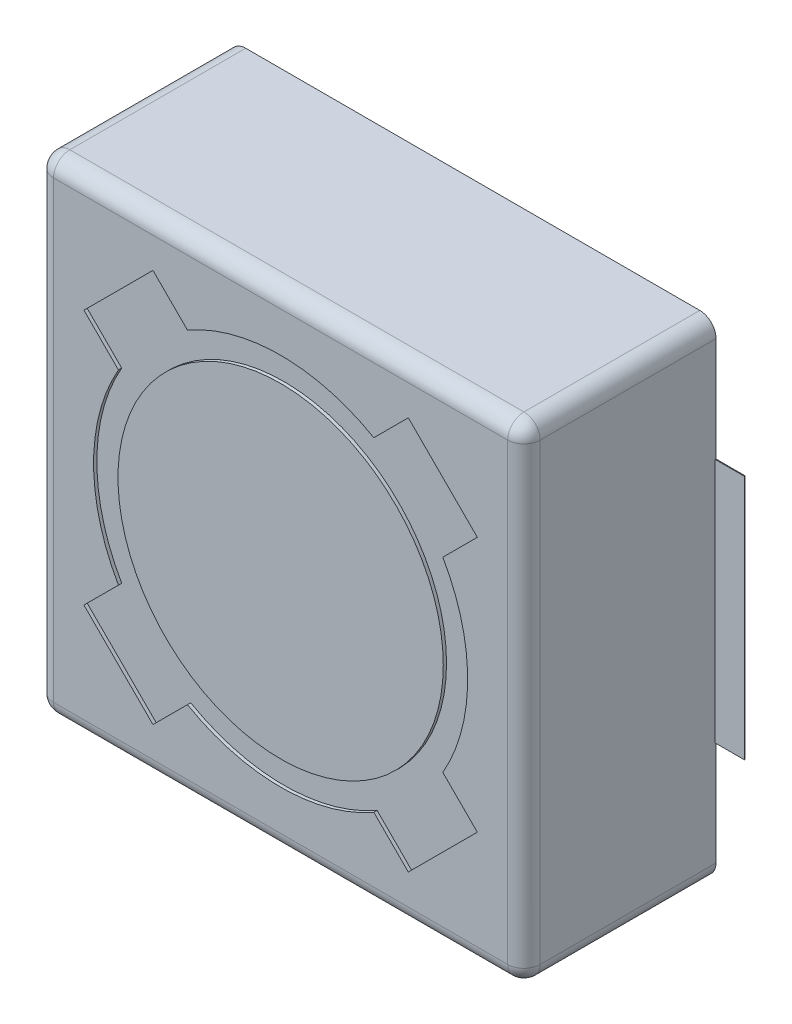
ISO-10303-21;
HEADER;
FILE_DESCRIPTION(('STEP AP214'),'2;1');
FILE_NAME('part.step','',(''),(''),'','','');
FILE_SCHEMA(('AUTOMOTIVE_DESIGN { 1 0 10303 214 1 1 1 1 }'));
ENDSEC;
DATA;
#1=APPLICATION_CONTEXT('core data for automotive mechanical design processes');
#2=APPLICATION_PROTOCOL_DEFINITION('international standard','automotive_design',2000,#1);
#3=PRODUCT_CONTEXT('',#1,'mechanical');
#4=PRODUCT('Part','Part','',(#3));
#5=PRODUCT_RELATED_PRODUCT_CATEGORY('part','',(#4));
#6=PRODUCT_DEFINITION_FORMATION('','',#4);
#7=PRODUCT_DEFINITION_CONTEXT('part definition',#1,'design');
#8=PRODUCT_DEFINITION('design','',#6,#7);
#9=PRODUCT_DEFINITION_SHAPE('','',#8);
#10=(LENGTH_UNIT() NAMED_UNIT(*) SI_UNIT(.MILLI.,.METRE.));
#11=(NAMED_UNIT(*) PLANE_ANGLE_UNIT() SI_UNIT($,.RADIAN.));
#12=(NAMED_UNIT(*) SI_UNIT($,.STERADIAN.) SOLID_ANGLE_UNIT());
#13=UNCERTAINTY_MEASURE_WITH_UNIT(LENGTH_MEASURE(1.E-05),#10,'distance_accuracy_value','');
#14=(GEOMETRIC_REPRESENTATION_CONTEXT(3) GLOBAL_UNCERTAINTY_ASSIGNED_CONTEXT((#13)) GLOBAL_UNIT_ASSIGNED_CONTEXT((#10,
#11,#12)) REPRESENTATION_CONTEXT('',''));
#15=CARTESIAN_POINT('',(0.,0.,0.));
#16=DIRECTION('',(0.,0.,1.));
#17=DIRECTION('',(1.,0.,0.));
#18=AXIS2_PLACEMENT_3D('',#15,#16,#17);
#19=CARTESIAN_POINT('',(0.,0.,3.076194));
#20=DIRECTION('',(0.,0.,1.));
#21=DIRECTION('',(1.,0.,0.));
#22=AXIS2_PLACEMENT_3D('',#19,#20,#21);
#23=PLANE('',#22);
#24=CARTESIAN_POINT('',(0.,0.,3.076194));
#25=DIRECTION('',(0.,0.,1.));
#26=DIRECTION('',(1.,0.,0.));
#27=AXIS2_PLACEMENT_3D('',#24,#25,#26);
#28=CIRCLE('',#27,2.54);
#29=CARTESIAN_POINT('',(2.54,0.,3.076194));
#30=VERTEX_POINT('',#29);
#31=EDGE_CURVE('E19',#30,#30,#28,.F.);
#32=ORIENTED_EDGE('',*,*,#31,.F.);
#33=EDGE_LOOP('',(#32));
#34=FACE_BOUND('',#33,.T.);
#35=ADVANCED_FACE('F16',(#34),#23,.T.);
#36=CARTESIAN_POINT('',(0.,0.,3.076194));
#37=DIRECTION('',(0.,0.,1.));
#38=DIRECTION('',(1.,0.,0.));
#39=AXIS2_PLACEMENT_3D('',#36,#37,#38);
#40=CYLINDRICAL_SURFACE('',#39,2.54);
#41=CARTESIAN_POINT('',(0.,0.,3.025394));
#42=DIRECTION('',(0.,0.,1.));
#43=DIRECTION('',(1.,0.,0.));
#44=AXIS2_PLACEMENT_3D('',#41,#42,#43);
#45=CIRCLE('',#44,2.54);
#46=CARTESIAN_POINT('',(2.54,0.,3.025394));
#47=VERTEX_POINT('',#46);
#48=EDGE_CURVE('E389',#47,#47,#45,.F.);
#49=ORIENTED_EDGE('',*,*,#48,.F.);
#50=EDGE_LOOP('',(#49));
#51=FACE_BOUND('',#50,.T.);
#52=ORIENTED_EDGE('',*,*,#31,.T.);
#53=EDGE_LOOP('',(#52));
#54=FACE_BOUND('',#53,.T.);
#55=ADVANCED_FACE('F829',(#51,#54),#40,.T.);
#56=CARTESIAN_POINT('',(0.,0.,3.025394));
#57=DIRECTION('',(0.,0.,1.));
#58=DIRECTION('',(1.,0.,0.));
#59=AXIS2_PLACEMENT_3D('',#56,#57,#58);
#60=PLANE('',#59);
#61=ORIENTED_EDGE('',*,*,#48,.T.);
#62=EDGE_LOOP('',(#61));
#63=FACE_BOUND('',#62,.T.);
#64=DIRECTION('',(-0.707106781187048,-0.707106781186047,0.));
#65=VECTOR('',#64,1.);
#66=CARTESIAN_POINT('',(1.99394044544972,3.07157117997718,3.025394));
#67=LINE('',#66,#65);
#68=CARTESIAN_POINT('',(1.99394044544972,3.07157117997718,3.025394));
#69=VERTEX_POINT('',#68);
#70=CARTESIAN_POINT('',(1.45512507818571,2.53275581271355,3.025394));
#71=VERTEX_POINT('',#70);
#72=EDGE_CURVE('E306',#69,#71,#67,.T.);
#73=ORIENTED_EDGE('',*,*,#72,.T.);
#74=CARTESIAN_POINT('',(0.,0.,3.025394));
#75=DIRECTION('',(0.,0.,1.));
#76=DIRECTION('',(1.,0.,0.));
#77=AXIS2_PLACEMENT_3D('',#74,#75,#76);
#78=CIRCLE('',#77,2.921);
#79=CARTESIAN_POINT('',(-1.45512507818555,2.53275581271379,3.025394));
#80=VERTEX_POINT('',#79);
#81=EDGE_CURVE('E377',#71,#80,#78,.T.);
#82=ORIENTED_EDGE('',*,*,#81,.T.);
#83=DIRECTION('',(-0.707106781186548,0.707106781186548,0.));
#84=VECTOR('',#83,1.);
#85=CARTESIAN_POINT('',(-1.45512507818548,2.5327558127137,3.025394));
#86=LINE('',#85,#84);
#87=CARTESIAN_POINT('',(-1.99394044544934,3.07157117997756,3.025394));
#88=VERTEX_POINT('',#87);
#89=EDGE_CURVE('E477',#80,#88,#86,.T.);
#90=ORIENTED_EDGE('',*,*,#89,.T.);
#91=DIRECTION('',(-0.707106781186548,-0.707106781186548,0.));
#92=VECTOR('',#91,1.);
#93=CARTESIAN_POINT('',(-1.99394044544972,3.07157117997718,3.025394));
#94=LINE('',#93,#92);
#95=CARTESIAN_POINT('',(-3.07157117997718,1.99394044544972,3.025394));
#96=VERTEX_POINT('',#95);
#97=EDGE_CURVE('E405',#88,#96,#94,.T.);
#98=ORIENTED_EDGE('',*,*,#97,.T.);
#99=DIRECTION('',(0.707106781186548,-0.707106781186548,0.));
#100=VECTOR('',#99,1.);
#101=CARTESIAN_POINT('',(-3.07157117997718,1.99394044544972,3.025394));
#102=LINE('',#101,#100);
#103=CARTESIAN_POINT('',(-2.53275581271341,1.45512507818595,3.025394));
#104=VERTEX_POINT('',#103);
#105=EDGE_CURVE('E385',#96,#104,#102,.T.);
#106=ORIENTED_EDGE('',*,*,#105,.T.);
#107=CARTESIAN_POINT('',(0.,0.,3.025394));
#108=DIRECTION('',(0.,0.,1.));
#109=DIRECTION('',(1.,0.,0.));
#110=AXIS2_PLACEMENT_3D('',#107,#108,#109);
#111=CIRCLE('',#110,2.921);
#112=CARTESIAN_POINT('',(-2.53275581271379,-1.45512507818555,3.025394));
#113=VERTEX_POINT('',#112);
#114=EDGE_CURVE('E382',#104,#113,#111,.T.);
#115=ORIENTED_EDGE('',*,*,#114,.T.);
#116=DIRECTION('',(-0.707106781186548,-0.707106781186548,0.));
#117=VECTOR('',#116,1.);
#118=CARTESIAN_POINT('',(-2.5327558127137,-1.45512507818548,3.025394));
#119=LINE('',#118,#117);
#120=CARTESIAN_POINT('',(-3.07157117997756,-1.99394044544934,3.025394));
#121=VERTEX_POINT('',#120);
#122=EDGE_CURVE('E416',#113,#121,#119,.T.);
#123=ORIENTED_EDGE('',*,*,#122,.T.);
#124=DIRECTION('',(0.707106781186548,-0.707106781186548,0.));
#125=VECTOR('',#124,1.);
#126=CARTESIAN_POINT('',(-3.07157117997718,-1.99394044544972,3.025394));
#127=LINE('',#126,#125);
#128=CARTESIAN_POINT('',(-1.99394044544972,-3.07157117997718,3.025394));
#129=VERTEX_POINT('',#128);
#130=EDGE_CURVE('E423',#121,#129,#127,.T.);
#131=ORIENTED_EDGE('',*,*,#130,.T.);
#132=DIRECTION('',(0.707106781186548,0.707106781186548,0.));
#133=VECTOR('',#132,1.);
#134=CARTESIAN_POINT('',(-1.99394044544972,-3.07157117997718,3.025394));
#135=LINE('',#134,#133);
#136=CARTESIAN_POINT('',(-1.45512507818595,-2.53275581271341,3.025394));
#137=VERTEX_POINT('',#136);
#138=EDGE_CURVE('E388',#129,#137,#135,.T.);
#139=ORIENTED_EDGE('',*,*,#138,.T.);
#140=CARTESIAN_POINT('',(0.,0.,3.025394));
#141=DIRECTION('',(0.,0.,1.));
#142=DIRECTION('',(1.,0.,0.));
#143=AXIS2_PLACEMENT_3D('',#140,#141,#142);
#144=CIRCLE('',#143,2.921);
#145=CARTESIAN_POINT('',(1.45512507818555,-2.53275581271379,3.025394));
#146=VERTEX_POINT('',#145);
#147=EDGE_CURVE('E290',#137,#146,#144,.T.);
#148=ORIENTED_EDGE('',*,*,#147,.T.);
#149=DIRECTION('',(0.707106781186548,-0.707106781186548,0.));
#150=VECTOR('',#149,1.);
#151=CARTESIAN_POINT('',(1.45512507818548,-2.5327558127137,3.025394));
#152=LINE('',#151,#150);
#153=CARTESIAN_POINT('',(1.99394044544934,-3.07157117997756,3.025394));
#154=VERTEX_POINT('',#153);
#155=EDGE_CURVE('E282',#146,#154,#152,.T.);
#156=ORIENTED_EDGE('',*,*,#155,.T.);
#157=DIRECTION('',(0.707106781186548,0.707106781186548,0.));
#158=VECTOR('',#157,1.);
#159=CARTESIAN_POINT('',(1.99394044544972,-3.07157117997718,3.025394));
#160=LINE('',#159,#158);
#161=CARTESIAN_POINT('',(3.07157117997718,-1.99394044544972,3.025394));
#162=VERTEX_POINT('',#161);
#163=EDGE_CURVE('E267',#154,#162,#160,.T.);
#164=ORIENTED_EDGE('',*,*,#163,.T.);
#165=DIRECTION('',(-0.707106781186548,0.707106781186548,0.));
#166=VECTOR('',#165,1.);
#167=CARTESIAN_POINT('',(3.07157117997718,-1.99394044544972,3.025394));
#168=LINE('',#167,#166);
#169=CARTESIAN_POINT('',(2.53275581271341,-1.45512507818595,3.025394));
#170=VERTEX_POINT('',#169);
#171=EDGE_CURVE('E301',#162,#170,#168,.T.);
#172=ORIENTED_EDGE('',*,*,#171,.T.);
#173=CARTESIAN_POINT('',(0.,0.,3.025394));
#174=DIRECTION('',(0.,0.,1.));
#175=DIRECTION('',(1.,0.,0.));
#176=AXIS2_PLACEMENT_3D('',#173,#174,#175);
#177=CIRCLE('',#176,2.921);
#178=CARTESIAN_POINT('',(2.53275581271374,1.45512507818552,3.025394));
#179=VERTEX_POINT('',#178);
#180=EDGE_CURVE('E145',#170,#179,#177,.T.);
#181=ORIENTED_EDGE('',*,*,#180,.T.);
#182=DIRECTION('',(0.707106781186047,0.707106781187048,0.));
#183=VECTOR('',#182,1.);
#184=CARTESIAN_POINT('',(2.5327558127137,1.45512507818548,3.025394));
#185=LINE('',#184,#183);
#186=CARTESIAN_POINT('',(3.07157117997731,1.99394044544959,3.025394));
#187=VERTEX_POINT('',#186);
#188=EDGE_CURVE('E307',#179,#187,#185,.T.);
#189=ORIENTED_EDGE('',*,*,#188,.T.);
#190=DIRECTION('',(-0.707106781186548,0.707106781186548,0.));
#191=VECTOR('',#190,1.);
#192=CARTESIAN_POINT('',(3.07157117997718,1.99394044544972,3.025394));
#193=LINE('',#192,#191);
#194=EDGE_CURVE('E155',#187,#69,#193,.T.);
#195=ORIENTED_EDGE('',*,*,#194,.T.);
#196=EDGE_LOOP('',(#73,#82,#90,#98,#106,#115,#123,#131,#139,#148,#156,#164,#172,#181,#189,#195));
#197=FACE_BOUND('',#196,.T.);
#198=ADVANCED_FACE('F288',(#63,#197),#60,.T.);
#199=CARTESIAN_POINT('',(-3.54600000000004,3.81813888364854,2.822194));
#200=DIRECTION('',(0.,-1.,0.));
#201=DIRECTION('',(0.,0.,-1.));
#202=AXIS2_PLACEMENT_3D('',#199,#200,#201);
#203=CYLINDRICAL_SURFACE('',#202,0.254);
#204=CARTESIAN_POINT('',(-3.54600000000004,-3.54600000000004,2.822194));
#205=DIRECTION('',(0.,-1.,0.));
#206=DIRECTION('',(0.,0.,-1.));
#207=AXIS2_PLACEMENT_3D('',#204,#205,#206);
#208=CIRCLE('',#207,0.254);
#209=CARTESIAN_POINT('',(-3.54600000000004,-3.54600000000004,3.076194));
#210=VERTEX_POINT('',#209);
#211=CARTESIAN_POINT('',(-3.80000000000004,-3.54600000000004,2.822194));
#212=VERTEX_POINT('',#211);
#213=EDGE_CURVE('E370',#210,#212,#208,.T.);
#214=ORIENTED_EDGE('',*,*,#213,.F.);
#215=DIRECTION('',(0.,1.,0.));
#216=VECTOR('',#215,1.);
#217=CARTESIAN_POINT('',(-3.54600000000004,0.,3.076194));
#218=LINE('',#217,#216);
#219=CARTESIAN_POINT('',(-3.54600000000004,3.54600000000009,3.076194));
#220=VERTEX_POINT('',#219);
#221=EDGE_CURVE('E365',#220,#210,#218,.F.);
#222=ORIENTED_EDGE('',*,*,#221,.F.);
#223=CARTESIAN_POINT('',(-3.54600000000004,3.54600000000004,2.822194));
#224=DIRECTION('',(-3.72868402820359E-13,1.,-3.72868402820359E-13));
#225=DIRECTION('',(-0.707106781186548,0.,0.707106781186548));
#226=AXIS2_PLACEMENT_3D('',#223,#224,#225);
#227=CIRCLE('',#226,0.254);
#228=CARTESIAN_POINT('',(-3.72560512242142,3.54600000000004,3.00179912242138));
#229=VERTEX_POINT('',#228);
#230=EDGE_CURVE('E368',#229,#220,#227,.T.);
#231=ORIENTED_EDGE('',*,*,#230,.F.);
#232=CARTESIAN_POINT('',(-3.54600000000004,3.54600000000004,2.822194));
#233=DIRECTION('',(0.,-1.,0.));
#234=DIRECTION('',(0.,0.,-1.));
#235=AXIS2_PLACEMENT_3D('',#232,#233,#234);
#236=CIRCLE('',#235,0.254);
#237=CARTESIAN_POINT('',(-3.80000000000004,3.54600000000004,2.822194));
#238=VERTEX_POINT('',#237);
#239=EDGE_CURVE('E366',#238,#229,#236,.F.);
#240=ORIENTED_EDGE('',*,*,#239,.F.);
#241=DIRECTION('',(0.,1.,0.));
#242=VECTOR('',#241,1.);
#243=CARTESIAN_POINT('',(-3.80000000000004,3.80000000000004,2.822194));
#244=LINE('',#243,#242);
#245=EDGE_CURVE('E573',#212,#238,#244,.T.);
#246=ORIENTED_EDGE('',*,*,#245,.F.);
#247=EDGE_LOOP('',(#214,#222,#231,#240,#246));
#248=FACE_BOUND('',#247,.T.);
#249=ADVANCED_FACE('F802',(#248),#203,.T.);
#250=CARTESIAN_POINT('',(0.,0.,3.076194));
#251=DIRECTION('',(0.,0.,1.));
#252=DIRECTION('',(1.,0.,0.));
#253=AXIS2_PLACEMENT_3D('',#250,#251,#252);
#254=CYLINDRICAL_SURFACE('',#253,2.921);
#255=DIRECTION('',(0.,0.,1.));
#256=VECTOR('',#255,1.);
#257=CARTESIAN_POINT('',(2.53275581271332,-1.45512507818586,3.076194));
#258=LINE('',#257,#256);
#259=CARTESIAN_POINT('',(2.53275581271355,-1.45512507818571,3.076194));
#260=VERTEX_POINT('',#259);
#261=EDGE_CURVE('E277',#170,#260,#258,.T.);
#262=ORIENTED_EDGE('',*,*,#261,.T.);
#263=CARTESIAN_POINT('',(0.,0.,3.076194));
#264=DIRECTION('',(0.,0.,1.));
#265=DIRECTION('',(1.,0.,0.));
#266=AXIS2_PLACEMENT_3D('',#263,#264,#265);
#267=CIRCLE('',#266,2.921);
#268=CARTESIAN_POINT('',(2.53275581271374,1.45512507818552,3.076194));
#269=VERTEX_POINT('',#268);
#270=EDGE_CURVE('E362',#269,#260,#267,.F.);
#271=ORIENTED_EDGE('',*,*,#270,.F.);
#272=DIRECTION('',(0.,0.,1.));
#273=VECTOR('',#272,1.);
#274=CARTESIAN_POINT('',(2.5327558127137,1.45512507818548,3.076194));
#275=LINE('',#274,#273);
#276=EDGE_CURVE('E600',#269,#179,#275,.F.);
#277=ORIENTED_EDGE('',*,*,#276,.T.);
#278=ORIENTED_EDGE('',*,*,#180,.F.);
#279=EDGE_LOOP('',(#262,#271,#277,#278));
#280=FACE_BOUND('',#279,.T.);
#281=ADVANCED_FACE('F821',(#280),#254,.F.);
#282=CARTESIAN_POINT('',(3.07157117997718,-1.99394044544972,3.076194));
#283=DIRECTION('',(0.707106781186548,0.707106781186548,0.));
#284=DIRECTION('',(-0.707106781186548,0.707106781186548,0.));
#285=AXIS2_PLACEMENT_3D('',#282,#283,#284);
#286=PLANE('',#285);
#287=ORIENTED_EDGE('',*,*,#171,.F.);
#288=DIRECTION('',(0.,0.,1.));
#289=VECTOR('',#288,1.);
#290=CARTESIAN_POINT('',(3.07157117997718,-1.99394044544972,3.076194));
#291=LINE('',#290,#289);
#292=CARTESIAN_POINT('',(3.07157117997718,-1.99394044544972,3.076194));
#293=VERTEX_POINT('',#292);
#294=EDGE_CURVE('E274',#162,#293,#291,.T.);
#295=ORIENTED_EDGE('',*,*,#294,.T.);
#296=DIRECTION('',(0.707106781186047,-0.707106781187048,0.));
#297=VECTOR('',#296,1.);
#298=CARTESIAN_POINT('',(2.5327558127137,-1.45512507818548,3.076194));
#299=LINE('',#298,#297);
#300=EDGE_CURVE('E364',#260,#293,#299,.T.);
#301=ORIENTED_EDGE('',*,*,#300,.F.);
#302=ORIENTED_EDGE('',*,*,#261,.F.);
#303=EDGE_LOOP('',(#287,#295,#301,#302));
#304=FACE_BOUND('',#303,.T.);
#305=ADVANCED_FACE('F827',(#304),#286,.F.);
#306=CARTESIAN_POINT('',(1.99394044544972,-3.07157117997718,3.076194));
#307=DIRECTION('',(0.707106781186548,-0.707106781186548,0.));
#308=DIRECTION('',(0.707106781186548,0.707106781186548,0.));
#309=AXIS2_PLACEMENT_3D('',#306,#307,#308);
#310=PLANE('',#309);
#311=ORIENTED_EDGE('',*,*,#163,.F.);
#312=DIRECTION('',(0.,0.,1.));
#313=VECTOR('',#312,1.);
#314=CARTESIAN_POINT('',(1.99394044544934,-3.07157117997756,3.076194));
#315=LINE('',#314,#313);
#316=CARTESIAN_POINT('',(1.99394044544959,-3.07157117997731,3.076194));
#317=VERTEX_POINT('',#316);
#318=EDGE_CURVE('E271',#154,#317,#315,.T.);
#319=ORIENTED_EDGE('',*,*,#318,.T.);
#320=DIRECTION('',(-0.707106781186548,-0.707106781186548,0.));
#321=VECTOR('',#320,1.);
#322=CARTESIAN_POINT('',(3.07157117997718,-1.99394044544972,3.076194));
#323=LINE('',#322,#321);
#324=EDGE_CURVE('E441',#293,#317,#323,.T.);
#325=ORIENTED_EDGE('',*,*,#324,.F.);
#326=ORIENTED_EDGE('',*,*,#294,.F.);
#327=EDGE_LOOP('',(#311,#319,#325,#326));
#328=FACE_BOUND('',#327,.T.);
#329=ADVANCED_FACE('F269',(#328),#310,.F.);
#330=CARTESIAN_POINT('',(1.45512507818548,-2.5327558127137,3.076194));
#331=DIRECTION('',(-0.707106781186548,-0.707106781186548,0.));
#332=DIRECTION('',(0.707106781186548,-0.707106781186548,0.));
#333=AXIS2_PLACEMENT_3D('',#330,#331,#332);
#334=PLANE('',#333);
#335=ORIENTED_EDGE('',*,*,#155,.F.);
#336=DIRECTION('',(0.,0.,1.));
#337=VECTOR('',#336,1.);
#338=CARTESIAN_POINT('',(1.45512507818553,-2.5327558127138,3.076194));
#339=LINE('',#338,#337);
#340=CARTESIAN_POINT('',(1.45512507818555,-2.53275581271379,3.076194));
#341=VERTEX_POINT('',#340);
#342=EDGE_CURVE('E285',#146,#341,#339,.T.);
#343=ORIENTED_EDGE('',*,*,#342,.T.);
#344=DIRECTION('',(-0.707106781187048,0.707106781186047,0.));
#345=VECTOR('',#344,1.);
#346=CARTESIAN_POINT('',(1.99394044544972,-3.07157117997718,3.076194));
#347=LINE('',#346,#345);
#348=EDGE_CURVE('E284',#317,#341,#347,.T.);
#349=ORIENTED_EDGE('',*,*,#348,.F.);
#350=ORIENTED_EDGE('',*,*,#318,.F.);
#351=EDGE_LOOP('',(#335,#343,#349,#350));
#352=FACE_BOUND('',#351,.T.);
#353=ADVANCED_FACE('F280',(#352),#334,.F.);
#354=CARTESIAN_POINT('',(0.,0.,3.076194));
#355=DIRECTION('',(0.,0.,1.));
#356=DIRECTION('',(1.,0.,0.));
#357=AXIS2_PLACEMENT_3D('',#354,#355,#356);
#358=CYLINDRICAL_SURFACE('',#357,2.921);
#359=DIRECTION('',(0.,0.,1.));
#360=VECTOR('',#359,1.);
#361=CARTESIAN_POINT('',(-1.45512507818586,-2.53275581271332,3.076194));
#362=LINE('',#361,#360);
#363=CARTESIAN_POINT('',(-1.45512507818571,-2.53275581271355,3.076194));
#364=VERTEX_POINT('',#363);
#365=EDGE_CURVE('E426',#137,#364,#362,.T.);
#366=ORIENTED_EDGE('',*,*,#365,.T.);
#367=CARTESIAN_POINT('',(0.,0.,3.076194));
#368=DIRECTION('',(0.,0.,1.));
#369=DIRECTION('',(1.,0.,0.));
#370=AXIS2_PLACEMENT_3D('',#367,#368,#369);
#371=CIRCLE('',#370,2.921);
#372=EDGE_CURVE('E359',#341,#364,#371,.F.);
#373=ORIENTED_EDGE('',*,*,#372,.F.);
#374=ORIENTED_EDGE('',*,*,#342,.F.);
#375=ORIENTED_EDGE('',*,*,#147,.F.);
#376=EDGE_LOOP('',(#366,#373,#374,#375));
#377=FACE_BOUND('',#376,.T.);
#378=ADVANCED_FACE('F896',(#377),#358,.F.);
#379=CARTESIAN_POINT('',(-1.99394044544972,-3.07157117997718,3.076194));
#380=DIRECTION('',(0.707106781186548,-0.707106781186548,0.));
#381=DIRECTION('',(0.707106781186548,0.707106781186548,0.));
#382=AXIS2_PLACEMENT_3D('',#379,#380,#381);
#383=PLANE('',#382);
#384=ORIENTED_EDGE('',*,*,#138,.F.);
#385=DIRECTION('',(0.,0.,1.));
#386=VECTOR('',#385,1.);
#387=CARTESIAN_POINT('',(-1.99394044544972,-3.07157117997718,3.076194));
#388=LINE('',#387,#386);
#389=CARTESIAN_POINT('',(-1.99394044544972,-3.07157117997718,3.076194));
#390=VERTEX_POINT('',#389);
#391=EDGE_CURVE('E420',#129,#390,#388,.T.);
#392=ORIENTED_EDGE('',*,*,#391,.T.);
#393=DIRECTION('',(-0.707106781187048,-0.707106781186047,0.));
#394=VECTOR('',#393,1.);
#395=CARTESIAN_POINT('',(-1.45512507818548,-2.5327558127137,3.076194));
#396=LINE('',#395,#394);
#397=EDGE_CURVE('E361',#364,#390,#396,.T.);
#398=ORIENTED_EDGE('',*,*,#397,.F.);
#399=ORIENTED_EDGE('',*,*,#365,.F.);
#400=EDGE_LOOP('',(#384,#392,#398,#399));
#401=FACE_BOUND('',#400,.T.);
#402=ADVANCED_FACE('F508',(#401),#383,.F.);
#403=CARTESIAN_POINT('',(-3.07157117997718,-1.99394044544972,3.076194));
#404=DIRECTION('',(-0.707106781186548,-0.707106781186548,0.));
#405=DIRECTION('',(0.707106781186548,-0.707106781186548,0.));
#406=AXIS2_PLACEMENT_3D('',#403,#404,#405);
#407=PLANE('',#406);
#408=ORIENTED_EDGE('',*,*,#130,.F.);
#409=DIRECTION('',(0.,0.,1.));
#410=VECTOR('',#409,1.);
#411=CARTESIAN_POINT('',(-3.07157117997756,-1.99394044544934,3.076194));
#412=LINE('',#411,#410);
#413=CARTESIAN_POINT('',(-3.07157117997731,-1.99394044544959,3.076194));
#414=VERTEX_POINT('',#413);
#415=EDGE_CURVE('E419',#121,#414,#412,.T.);
#416=ORIENTED_EDGE('',*,*,#415,.T.);
#417=DIRECTION('',(-0.707106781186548,0.707106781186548,0.));
#418=VECTOR('',#417,1.);
#419=CARTESIAN_POINT('',(-1.99394044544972,-3.07157117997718,3.076194));
#420=LINE('',#419,#418);
#421=EDGE_CURVE('E501',#390,#414,#420,.T.);
#422=ORIENTED_EDGE('',*,*,#421,.F.);
#423=ORIENTED_EDGE('',*,*,#391,.F.);
#424=EDGE_LOOP('',(#408,#416,#422,#423));
#425=FACE_BOUND('',#424,.T.);
#426=ADVANCED_FACE('F510',(#425),#407,.F.);
#427=CARTESIAN_POINT('',(-2.5327558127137,-1.45512507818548,3.076194));
#428=DIRECTION('',(-0.707106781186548,0.707106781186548,0.));
#429=DIRECTION('',(-0.707106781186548,-0.707106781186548,0.));
#430=AXIS2_PLACEMENT_3D('',#427,#428,#429);
#431=PLANE('',#430);
#432=ORIENTED_EDGE('',*,*,#122,.F.);
#433=DIRECTION('',(0.,0.,1.));
#434=VECTOR('',#433,1.);
#435=CARTESIAN_POINT('',(-2.5327558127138,-1.45512507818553,3.076194));
#436=LINE('',#435,#434);
#437=CARTESIAN_POINT('',(-2.53275581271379,-1.45512507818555,3.076194));
#438=VERTEX_POINT('',#437);
#439=EDGE_CURVE('E386',#113,#438,#436,.T.);
#440=ORIENTED_EDGE('',*,*,#439,.T.);
#441=DIRECTION('',(0.707106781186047,0.707106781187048,0.));
#442=VECTOR('',#441,1.);
#443=CARTESIAN_POINT('',(-3.07157117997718,-1.99394044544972,3.076194));
#444=LINE('',#443,#442);
#445=EDGE_CURVE('E358',#414,#438,#444,.T.);
#446=ORIENTED_EDGE('',*,*,#445,.F.);
#447=ORIENTED_EDGE('',*,*,#415,.F.);
#448=EDGE_LOOP('',(#432,#440,#446,#447));
#449=FACE_BOUND('',#448,.T.);
#450=ADVANCED_FACE('F921',(#449),#431,.F.);
#451=CARTESIAN_POINT('',(0.,0.,3.076194));
#452=DIRECTION('',(0.,0.,1.));
#453=DIRECTION('',(1.,0.,0.));
#454=AXIS2_PLACEMENT_3D('',#451,#452,#453);
#455=CYLINDRICAL_SURFACE('',#454,2.921);
#456=DIRECTION('',(0.,0.,1.));
#457=VECTOR('',#456,1.);
#458=CARTESIAN_POINT('',(-2.53275581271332,1.45512507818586,3.076194));
#459=LINE('',#458,#457);
#460=CARTESIAN_POINT('',(-2.53275581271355,1.45512507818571,3.076194));
#461=VERTEX_POINT('',#460);
#462=EDGE_CURVE('E409',#104,#461,#459,.T.);
#463=ORIENTED_EDGE('',*,*,#462,.T.);
#464=CARTESIAN_POINT('',(0.,0.,3.076194));
#465=DIRECTION('',(0.,0.,1.));
#466=DIRECTION('',(1.,0.,0.));
#467=AXIS2_PLACEMENT_3D('',#464,#465,#466);
#468=CIRCLE('',#467,2.921);
#469=EDGE_CURVE('E355',#438,#461,#468,.F.);
#470=ORIENTED_EDGE('',*,*,#469,.F.);
#471=ORIENTED_EDGE('',*,*,#439,.F.);
#472=ORIENTED_EDGE('',*,*,#114,.F.);
#473=EDGE_LOOP('',(#463,#470,#471,#472));
#474=FACE_BOUND('',#473,.T.);
#475=ADVANCED_FACE('F930',(#474),#455,.F.);
#476=CARTESIAN_POINT('',(-3.07157117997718,1.99394044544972,3.076194));
#477=DIRECTION('',(-0.707106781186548,-0.707106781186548,0.));
#478=DIRECTION('',(0.707106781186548,-0.707106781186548,0.));
#479=AXIS2_PLACEMENT_3D('',#476,#477,#478);
#480=PLANE('',#479);
#481=ORIENTED_EDGE('',*,*,#105,.F.);
#482=DIRECTION('',(0.,0.,1.));
#483=VECTOR('',#482,1.);
#484=CARTESIAN_POINT('',(-3.07157117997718,1.99394044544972,3.076194));
#485=LINE('',#484,#483);
#486=CARTESIAN_POINT('',(-3.07157117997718,1.99394044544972,3.076194));
#487=VERTEX_POINT('',#486);
#488=EDGE_CURVE('E408',#96,#487,#485,.T.);
#489=ORIENTED_EDGE('',*,*,#488,.T.);
#490=DIRECTION('',(-0.707106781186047,0.707106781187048,0.));
#491=VECTOR('',#490,1.);
#492=CARTESIAN_POINT('',(-2.5327558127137,1.45512507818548,3.076194));
#493=LINE('',#492,#491);
#494=EDGE_CURVE('E357',#461,#487,#493,.T.);
#495=ORIENTED_EDGE('',*,*,#494,.F.);
#496=ORIENTED_EDGE('',*,*,#462,.F.);
#497=EDGE_LOOP('',(#481,#489,#495,#496));
#498=FACE_BOUND('',#497,.T.);
#499=ADVANCED_FACE('F940',(#498),#480,.F.);
#500=CARTESIAN_POINT('',(-1.99394044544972,3.07157117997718,3.076194));
#501=DIRECTION('',(-0.707106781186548,0.707106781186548,0.));
#502=DIRECTION('',(-0.707106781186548,-0.707106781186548,0.));
#503=AXIS2_PLACEMENT_3D('',#500,#501,#502);
#504=PLANE('',#503);
#505=ORIENTED_EDGE('',*,*,#97,.F.);
#506=DIRECTION('',(0.,0.,1.));
#507=VECTOR('',#506,1.);
#508=CARTESIAN_POINT('',(-1.99394044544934,3.07157117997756,3.076194));
#509=LINE('',#508,#507);
#510=CARTESIAN_POINT('',(-1.99394044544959,3.07157117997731,3.076194));
#511=VERTEX_POINT('',#510);
#512=EDGE_CURVE('E381',#88,#511,#509,.T.);
#513=ORIENTED_EDGE('',*,*,#512,.T.);
#514=DIRECTION('',(0.707106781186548,0.707106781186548,0.));
#515=VECTOR('',#514,1.);
#516=CARTESIAN_POINT('',(-3.07157117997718,1.99394044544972,3.076194));
#517=LINE('',#516,#515);
#518=EDGE_CURVE('E621',#487,#511,#517,.T.);
#519=ORIENTED_EDGE('',*,*,#518,.F.);
#520=ORIENTED_EDGE('',*,*,#488,.F.);
#521=EDGE_LOOP('',(#505,#513,#519,#520));
#522=FACE_BOUND('',#521,.T.);
#523=ADVANCED_FACE('F950',(#522),#504,.F.);
#524=CARTESIAN_POINT('',(-1.45512507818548,2.5327558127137,3.076194));
#525=DIRECTION('',(0.707106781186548,0.707106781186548,0.));
#526=DIRECTION('',(-0.707106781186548,0.707106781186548,0.));
#527=AXIS2_PLACEMENT_3D('',#524,#525,#526);
#528=PLANE('',#527);
#529=ORIENTED_EDGE('',*,*,#89,.F.);
#530=DIRECTION('',(0.,0.,1.));
#531=VECTOR('',#530,1.);
#532=CARTESIAN_POINT('',(-1.45512507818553,2.5327558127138,3.076194));
#533=LINE('',#532,#531);
#534=CARTESIAN_POINT('',(-1.45512507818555,2.53275581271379,3.076194));
#535=VERTEX_POINT('',#534);
#536=EDGE_CURVE('E380',#80,#535,#533,.T.);
#537=ORIENTED_EDGE('',*,*,#536,.T.);
#538=DIRECTION('',(0.707106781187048,-0.707106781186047,0.));
#539=VECTOR('',#538,1.);
#540=CARTESIAN_POINT('',(-1.99394044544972,3.07157117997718,3.076194));
#541=LINE('',#540,#539);
#542=EDGE_CURVE('E354',#511,#535,#541,.T.);
#543=ORIENTED_EDGE('',*,*,#542,.F.);
#544=ORIENTED_EDGE('',*,*,#512,.F.);
#545=EDGE_LOOP('',(#529,#537,#543,#544));
#546=FACE_BOUND('',#545,.T.);
#547=ADVANCED_FACE('F959',(#546),#528,.F.);
#548=CARTESIAN_POINT('',(0.,0.,3.076194));
#549=DIRECTION('',(0.,0.,1.));
#550=DIRECTION('',(1.,0.,0.));
#551=AXIS2_PLACEMENT_3D('',#548,#549,#550);
#552=CYLINDRICAL_SURFACE('',#551,2.921);
#553=ORIENTED_EDGE('',*,*,#536,.F.);
#554=ORIENTED_EDGE('',*,*,#81,.F.);
#555=DIRECTION('',(0.,0.,1.));
#556=VECTOR('',#555,1.);
#557=CARTESIAN_POINT('',(1.45512507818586,2.53275581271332,3.076194));
#558=LINE('',#557,#556);
#559=CARTESIAN_POINT('',(1.45512507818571,2.53275581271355,3.076194));
#560=VERTEX_POINT('',#559);
#561=EDGE_CURVE('E613',#71,#560,#558,.T.);
#562=ORIENTED_EDGE('',*,*,#561,.T.);
#563=CARTESIAN_POINT('',(0.,0.,3.076194));
#564=DIRECTION('',(0.,0.,1.));
#565=DIRECTION('',(1.,0.,0.));
#566=AXIS2_PLACEMENT_3D('',#563,#564,#565);
#567=CIRCLE('',#566,2.921);
#568=EDGE_CURVE('E351',#535,#560,#567,.F.);
#569=ORIENTED_EDGE('',*,*,#568,.F.);
#570=EDGE_LOOP('',(#553,#554,#562,#569));
#571=FACE_BOUND('',#570,.T.);
#572=ADVANCED_FACE('F969',(#571),#552,.F.);
#573=CARTESIAN_POINT('',(1.99394044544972,3.07157117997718,3.076194));
#574=DIRECTION('',(-0.707106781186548,0.707106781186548,0.));
#575=DIRECTION('',(-0.707106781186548,-0.707106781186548,0.));
#576=AXIS2_PLACEMENT_3D('',#573,#574,#575);
#577=PLANE('',#576);
#578=ORIENTED_EDGE('',*,*,#72,.F.);
#579=DIRECTION('',(0.,0.,1.));
#580=VECTOR('',#579,1.);
#581=CARTESIAN_POINT('',(1.99394044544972,3.07157117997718,3.076194));
#582=LINE('',#581,#580);
#583=CARTESIAN_POINT('',(1.99394044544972,3.07157117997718,3.076194));
#584=VERTEX_POINT('',#583);
#585=EDGE_CURVE('E602',#69,#584,#582,.T.);
#586=ORIENTED_EDGE('',*,*,#585,.T.);
#587=DIRECTION('',(0.707106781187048,0.707106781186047,0.));
#588=VECTOR('',#587,1.);
#589=CARTESIAN_POINT('',(1.45512507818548,2.5327558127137,3.076194));
#590=LINE('',#589,#588);
#591=EDGE_CURVE('E353',#560,#584,#590,.T.);
#592=ORIENTED_EDGE('',*,*,#591,.F.);
#593=ORIENTED_EDGE('',*,*,#561,.F.);
#594=EDGE_LOOP('',(#578,#586,#592,#593));
#595=FACE_BOUND('',#594,.T.);
#596=ADVANCED_FACE('F979',(#595),#577,.F.);
#597=CARTESIAN_POINT('',(3.07157117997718,1.99394044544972,3.076194));
#598=DIRECTION('',(0.707106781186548,0.707106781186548,0.));
#599=DIRECTION('',(-0.707106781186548,0.707106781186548,0.));
#600=AXIS2_PLACEMENT_3D('',#597,#598,#599);
#601=PLANE('',#600);
#602=ORIENTED_EDGE('',*,*,#194,.F.);
#603=DIRECTION('',(0.,0.,1.));
#604=VECTOR('',#603,1.);
#605=CARTESIAN_POINT('',(3.07157117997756,1.99394044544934,3.076194));
#606=LINE('',#605,#604);
#607=CARTESIAN_POINT('',(3.07157117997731,1.99394044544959,3.076194));
#608=VERTEX_POINT('',#607);
#609=EDGE_CURVE('E376',#187,#608,#606,.T.);
#610=ORIENTED_EDGE('',*,*,#609,.T.);
#611=DIRECTION('',(0.707106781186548,-0.707106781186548,0.));
#612=VECTOR('',#611,1.);
#613=CARTESIAN_POINT('',(1.99394044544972,3.07157117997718,3.076194));
#614=LINE('',#613,#612);
#615=EDGE_CURVE('E607',#584,#608,#614,.T.);
#616=ORIENTED_EDGE('',*,*,#615,.F.);
#617=ORIENTED_EDGE('',*,*,#585,.F.);
#618=EDGE_LOOP('',(#602,#610,#616,#617));
#619=FACE_BOUND('',#618,.T.);
#620=ADVANCED_FACE('F989',(#619),#601,.F.);
#621=CARTESIAN_POINT('',(2.5327558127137,1.45512507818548,3.076194));
#622=DIRECTION('',(0.707106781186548,-0.707106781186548,0.));
#623=DIRECTION('',(0.707106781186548,0.707106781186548,0.));
#624=AXIS2_PLACEMENT_3D('',#621,#622,#623);
#625=PLANE('',#624);
#626=ORIENTED_EDGE('',*,*,#188,.F.);
#627=ORIENTED_EDGE('',*,*,#276,.F.);
#628=DIRECTION('',(-0.707106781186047,-0.707106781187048,0.));
#629=VECTOR('',#628,1.);
#630=CARTESIAN_POINT('',(3.07157117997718,1.99394044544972,3.076194));
#631=LINE('',#630,#629);
#632=EDGE_CURVE('E350',#608,#269,#631,.T.);
#633=ORIENTED_EDGE('',*,*,#632,.F.);
#634=ORIENTED_EDGE('',*,*,#609,.F.);
#635=EDGE_LOOP('',(#626,#627,#633,#634));
#636=FACE_BOUND('',#635,.T.);
#637=ADVANCED_FACE('F999',(#636),#625,.F.);
#638=CARTESIAN_POINT('',(3.54600000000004,-3.81778924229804,2.822194));
#639=DIRECTION('',(0.,1.,0.));
#640=DIRECTION('',(0.,0.,1.));
#641=AXIS2_PLACEMENT_3D('',#638,#639,#640);
#642=CYLINDRICAL_SURFACE('',#641,0.254);
#643=CARTESIAN_POINT('',(3.54600000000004,-3.54600000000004,2.822194));
#644=DIRECTION('',(0.,1.,0.));
#645=DIRECTION('',(0.,0.,1.));
#646=AXIS2_PLACEMENT_3D('',#643,#644,#645);
#647=CIRCLE('',#646,0.254);
#648=CARTESIAN_POINT('',(3.80000000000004,-3.54600000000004,2.822194));
#649=VERTEX_POINT('',#648);
#650=CARTESIAN_POINT('',(3.72560512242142,-3.54600000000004,3.00179912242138));
#651=VERTEX_POINT('',#650);
#652=EDGE_CURVE('E374',#649,#651,#647,.F.);
#653=ORIENTED_EDGE('',*,*,#652,.F.);
#654=DIRECTION('',(0.,1.,0.));
#655=VECTOR('',#654,1.);
#656=CARTESIAN_POINT('',(3.80000000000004,-3.80000000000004,2.822194));
#657=LINE('',#656,#655);
#658=CARTESIAN_POINT('',(3.80000000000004,3.54600000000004,2.822194));
#659=VERTEX_POINT('',#658);
#660=EDGE_CURVE('E567',#659,#649,#657,.F.);
#661=ORIENTED_EDGE('',*,*,#660,.F.);
#662=CARTESIAN_POINT('',(3.54600000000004,3.54600000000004,2.822194));
#663=DIRECTION('',(0.,1.,0.));
#664=DIRECTION('',(0.,0.,1.));
#665=AXIS2_PLACEMENT_3D('',#662,#663,#664);
#666=CIRCLE('',#665,0.254);
#667=CARTESIAN_POINT('',(3.54600000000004,3.54600000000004,3.076194));
#668=VERTEX_POINT('',#667);
#669=EDGE_CURVE('E347',#668,#659,#666,.T.);
#670=ORIENTED_EDGE('',*,*,#669,.F.);
#671=DIRECTION('',(0.,1.,0.));
#672=VECTOR('',#671,1.);
#673=CARTESIAN_POINT('',(3.54600000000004,0.,3.076194));
#674=LINE('',#673,#672);
#675=CARTESIAN_POINT('',(3.54600000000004,-3.54600000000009,3.076194));
#676=VERTEX_POINT('',#675);
#677=EDGE_CURVE('E529',#676,#668,#674,.T.);
#678=ORIENTED_EDGE('',*,*,#677,.F.);
#679=CARTESIAN_POINT('',(3.54600000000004,-3.54600000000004,2.822194));
#680=DIRECTION('',(3.72868402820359E-13,-1.,-3.72868402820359E-13));
#681=DIRECTION('',(0.707106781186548,0.,0.707106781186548));
#682=AXIS2_PLACEMENT_3D('',#679,#680,#681);
#683=CIRCLE('',#682,0.254);
#684=EDGE_CURVE('E373',#651,#676,#683,.T.);
#685=ORIENTED_EDGE('',*,*,#684,.F.);
#686=EDGE_LOOP('',(#653,#661,#670,#678,#685));
#687=FACE_BOUND('',#686,.T.);
#688=ADVANCED_FACE('F790',(#687),#642,.T.);
#689=CARTESIAN_POINT('',(3.54600000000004,-3.54600000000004,2.822194));
#690=DIRECTION('',(0.707106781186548,0.,0.707106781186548));
#691=DIRECTION('',(0.,-1.,0.));
#692=AXIS2_PLACEMENT_3D('',#689,#690,#691);
#693=SPHERICAL_SURFACE('',#692,0.254);
#694=ORIENTED_EDGE('',*,*,#652,.T.);
#695=ORIENTED_EDGE('',*,*,#684,.T.);
#696=CARTESIAN_POINT('',(3.54600000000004,-3.54600000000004,2.822194));
#697=DIRECTION('',(1.,0.,0.));
#698=DIRECTION('',(0.,0.,-1.));
#699=AXIS2_PLACEMENT_3D('',#696,#697,#698);
#700=CIRCLE('',#699,0.254);
#701=CARTESIAN_POINT('',(3.54600000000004,-3.80000000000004,2.822194));
#702=VERTEX_POINT('',#701);
#703=EDGE_CURVE('E334',#702,#676,#700,.F.);
#704=ORIENTED_EDGE('',*,*,#703,.F.);
#705=CARTESIAN_POINT('',(3.54600000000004,-3.54600000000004,2.822194));
#706=DIRECTION('',(0.,0.,-1.));
#707=DIRECTION('',(-1.,0.,0.));
#708=AXIS2_PLACEMENT_3D('',#705,#706,#707);
#709=CIRCLE('',#708,0.254);
#710=EDGE_CURVE('E337',#649,#702,#709,.T.);
#711=ORIENTED_EDGE('',*,*,#710,.F.);
#712=EDGE_LOOP('',(#694,#695,#704,#711));
#713=FACE_BOUND('',#712,.T.);
#714=ADVANCED_FACE('F550',(#713),#693,.T.);
#715=CARTESIAN_POINT('',(-3.54600000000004,-3.54600000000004,2.822194));
#716=DIRECTION('',(-0.707106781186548,-0.707106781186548,0.));
#717=DIRECTION('',(0.,0.,1.));
#718=AXIS2_PLACEMENT_3D('',#715,#716,#717);
#719=SPHERICAL_SURFACE('',#718,0.254);
#720=CARTESIAN_POINT('',(-3.54600000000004,-3.54600000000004,2.822194));
#721=DIRECTION('',(0.,0.,-1.));
#722=DIRECTION('',(-1.,0.,0.));
#723=AXIS2_PLACEMENT_3D('',#720,#721,#722);
#724=CIRCLE('',#723,0.254);
#725=CARTESIAN_POINT('',(-3.72560512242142,-3.72560512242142,2.822194));
#726=VERTEX_POINT('',#725);
#727=EDGE_CURVE('E342',#726,#212,#724,.T.);
#728=ORIENTED_EDGE('',*,*,#727,.F.);
#729=CARTESIAN_POINT('',(-3.54600000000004,-3.54600000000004,2.822194));
#730=DIRECTION('',(0.,0.,-1.));
#731=DIRECTION('',(-1.,0.,0.));
#732=AXIS2_PLACEMENT_3D('',#729,#730,#731);
#733=CIRCLE('',#732,0.254);
#734=CARTESIAN_POINT('',(-3.54600000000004,-3.80000000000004,2.822194));
#735=VERTEX_POINT('',#734);
#736=EDGE_CURVE('E34',#735,#726,#733,.T.);
#737=ORIENTED_EDGE('',*,*,#736,.F.);
#738=CARTESIAN_POINT('',(-3.54600000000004,-3.54600000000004,2.822194));
#739=DIRECTION('',(1.,0.,0.));
#740=DIRECTION('',(0.,0.,-1.));
#741=AXIS2_PLACEMENT_3D('',#738,#739,#740);
#742=CIRCLE('',#741,0.254);
#743=EDGE_CURVE('E329',#210,#735,#742,.T.);
#744=ORIENTED_EDGE('',*,*,#743,.F.);
#745=ORIENTED_EDGE('',*,*,#213,.T.);
#746=EDGE_LOOP('',(#728,#737,#744,#745));
#747=FACE_BOUND('',#746,.T.);
#748=ADVANCED_FACE('F545',(#747),#719,.T.);
#749=CARTESIAN_POINT('',(-3.80000000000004,3.80000000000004,0.0762));
#750=DIRECTION('',(-1.,0.,0.));
#751=DIRECTION('',(0.,0.,1.));
#752=AXIS2_PLACEMENT_3D('',#749,#750,#751);
#753=PLANE('',#752);
#754=DIRECTION('',(0.,0.,1.));
#755=VECTOR('',#754,1.);
#756=CARTESIAN_POINT('',(-3.80000000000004,1.9174968,0.0762));
#757=LINE('',#756,#755);
#758=CARTESIAN_POINT('',(-3.80000000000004,1.9174968,0.0762));
#759=VERTEX_POINT('',#758);
#760=CARTESIAN_POINT('',(-3.80000000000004,1.9174968,0.0889));
#761=VERTEX_POINT('',#760);
#762=EDGE_CURVE('E369',#759,#761,#757,.T.);
#763=ORIENTED_EDGE('',*,*,#762,.T.);
#764=DIRECTION('',(0.,1.,0.));
#765=VECTOR('',#764,1.);
#766=CARTESIAN_POINT('',(-3.80000000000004,0.,0.0889));
#767=LINE('',#766,#765);
#768=CARTESIAN_POINT('',(-3.80000000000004,-1.9174968,0.0889));
#769=VERTEX_POINT('',#768);
#770=EDGE_CURVE('E346',#769,#761,#767,.T.);
#771=ORIENTED_EDGE('',*,*,#770,.F.);
#772=DIRECTION('',(0.,0.,1.));
#773=VECTOR('',#772,1.);
#774=CARTESIAN_POINT('',(-3.80000000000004,-1.9174968,0.0762));
#775=LINE('',#774,#773);
#776=CARTESIAN_POINT('',(-3.80000000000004,-1.9174968,0.0762));
#777=VERTEX_POINT('',#776);
#778=EDGE_CURVE('E372',#769,#777,#775,.F.);
#779=ORIENTED_EDGE('',*,*,#778,.T.);
#780=DIRECTION('',(0.,1.,0.));
#781=VECTOR('',#780,1.);
#782=CARTESIAN_POINT('',(-3.80000000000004,3.80000000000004,0.0762));
#783=LINE('',#782,#781);
#784=CARTESIAN_POINT('',(-3.80000000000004,-3.54600000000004,0.0761999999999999));
#785=VERTEX_POINT('',#784);
#786=EDGE_CURVE('E466',#777,#785,#783,.F.);
#787=ORIENTED_EDGE('',*,*,#786,.T.);
#788=DIRECTION('',(0.,0.,-1.));
#789=VECTOR('',#788,1.);
#790=CARTESIAN_POINT('',(-3.80000000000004,-3.54600000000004,3.09465279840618));
#791=LINE('',#790,#789);
#792=EDGE_CURVE('E341',#212,#785,#791,.T.);
#793=ORIENTED_EDGE('',*,*,#792,.F.);
#794=ORIENTED_EDGE('',*,*,#245,.T.);
#795=DIRECTION('',(0.,0.,-1.));
#796=VECTOR('',#795,1.);
#797=CARTESIAN_POINT('',(-3.80000000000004,3.54600000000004,3.09465279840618));
#798=LINE('',#797,#796);
#799=CARTESIAN_POINT('',(-3.80000000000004,3.54600000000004,0.0761999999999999));
#800=VERTEX_POINT('',#799);
#801=EDGE_CURVE('E325',#800,#238,#798,.F.);
#802=ORIENTED_EDGE('',*,*,#801,.F.);
#803=DIRECTION('',(0.,1.,0.));
#804=VECTOR('',#803,1.);
#805=CARTESIAN_POINT('',(-3.80000000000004,3.80000000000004,0.0762));
#806=LINE('',#805,#804);
#807=EDGE_CURVE('E456',#800,#759,#806,.F.);
#808=ORIENTED_EDGE('',*,*,#807,.T.);
#809=EDGE_LOOP('',(#763,#771,#779,#787,#793,#794,#802,#808));
#810=FACE_BOUND('',#809,.T.);
#811=ADVANCED_FACE('F540',(#810),#753,.T.);
#812=CARTESIAN_POINT('',(-3.54600000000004,3.54600000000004,2.822194));
#813=DIRECTION('',(-0.707106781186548,0.,0.707106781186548));
#814=DIRECTION('',(0.,1.,0.));
#815=AXIS2_PLACEMENT_3D('',#812,#813,#814);
#816=SPHERICAL_SURFACE('',#815,0.254);
#817=ORIENTED_EDGE('',*,*,#239,.T.);
#818=ORIENTED_EDGE('',*,*,#230,.T.);
#819=CARTESIAN_POINT('',(-3.54600000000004,3.54600000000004,2.822194));
#820=DIRECTION('',(-1.,0.,0.));
#821=DIRECTION('',(0.,0.,1.));
#822=AXIS2_PLACEMENT_3D('',#819,#820,#821);
#823=CIRCLE('',#822,0.254);
#824=CARTESIAN_POINT('',(-3.54600000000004,3.80000000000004,2.822194));
#825=VERTEX_POINT('',#824);
#826=EDGE_CURVE('E319',#825,#220,#823,.F.);
#827=ORIENTED_EDGE('',*,*,#826,.F.);
#828=CARTESIAN_POINT('',(-3.54600000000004,3.54600000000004,2.822194));
#829=DIRECTION('',(0.,0.,-1.));
#830=DIRECTION('',(-1.,0.,0.));
#831=AXIS2_PLACEMENT_3D('',#828,#829,#830);
#832=CIRCLE('',#831,0.254);
#833=EDGE_CURVE('E323',#238,#825,#832,.T.);
#834=ORIENTED_EDGE('',*,*,#833,.F.);
#835=EDGE_LOOP('',(#817,#818,#827,#834));
#836=FACE_BOUND('',#835,.T.);
#837=ADVANCED_FACE('F536',(#836),#816,.T.);
#838=CARTESIAN_POINT('',(0.,0.,3.076194));
#839=DIRECTION('',(0.,0.,1.));
#840=DIRECTION('',(1.,0.,0.));
#841=AXIS2_PLACEMENT_3D('',#838,#839,#840);
#842=PLANE('',#841);
#843=ORIENTED_EDGE('',*,*,#615,.T.);
#844=ORIENTED_EDGE('',*,*,#632,.T.);
#845=ORIENTED_EDGE('',*,*,#270,.T.);
#846=ORIENTED_EDGE('',*,*,#300,.T.);
#847=ORIENTED_EDGE('',*,*,#324,.T.);
#848=ORIENTED_EDGE('',*,*,#348,.T.);
#849=ORIENTED_EDGE('',*,*,#372,.T.);
#850=ORIENTED_EDGE('',*,*,#397,.T.);
#851=ORIENTED_EDGE('',*,*,#421,.T.);
#852=ORIENTED_EDGE('',*,*,#445,.T.);
#853=ORIENTED_EDGE('',*,*,#469,.T.);
#854=ORIENTED_EDGE('',*,*,#494,.T.);
#855=ORIENTED_EDGE('',*,*,#518,.T.);
#856=ORIENTED_EDGE('',*,*,#542,.T.);
#857=ORIENTED_EDGE('',*,*,#568,.T.);
#858=ORIENTED_EDGE('',*,*,#591,.T.);
#859=EDGE_LOOP('',(#843,#844,#845,#846,#847,#848,#849,#850,#851,#852,#853,#854,#855,#856,#857,#858));
#860=FACE_BOUND('',#859,.T.);
#861=ORIENTED_EDGE('',*,*,#221,.T.);
#862=DIRECTION('',(1.,0.,0.));
#863=VECTOR('',#862,1.);
#864=CARTESIAN_POINT('',(-3.81813888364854,-3.54600000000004,3.076194));
#865=LINE('',#864,#863);
#866=EDGE_CURVE('E333',#676,#210,#865,.F.);
#867=ORIENTED_EDGE('',*,*,#866,.F.);
#868=ORIENTED_EDGE('',*,*,#677,.T.);
#869=DIRECTION('',(-1.,0.,0.));
#870=VECTOR('',#869,1.);
#871=CARTESIAN_POINT('',(3.8174410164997,3.54600000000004,3.076194));
#872=LINE('',#871,#870);
#873=EDGE_CURVE('E322',#220,#668,#872,.F.);
#874=ORIENTED_EDGE('',*,*,#873,.F.);
#875=EDGE_LOOP('',(#861,#867,#868,#874));
#876=FACE_BOUND('',#875,.T.);
#877=ADVANCED_FACE('F514',(#860,#876),#842,.T.);
#878=CARTESIAN_POINT('',(3.54600000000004,3.54600000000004,2.822194));
#879=DIRECTION('',(0.,0.707106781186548,0.707106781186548));
#880=DIRECTION('',(1.,0.,0.));
#881=AXIS2_PLACEMENT_3D('',#878,#879,#880);
#882=SPHERICAL_SURFACE('',#881,0.254);
#883=CARTESIAN_POINT('',(3.54600000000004,3.54600000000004,2.822194));
#884=DIRECTION('',(-1.,0.,0.));
#885=DIRECTION('',(0.,0.,1.));
#886=AXIS2_PLACEMENT_3D('',#883,#884,#885);
#887=CIRCLE('',#886,0.254);
#888=CARTESIAN_POINT('',(3.54600000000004,3.72560512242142,3.00179912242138));
#889=VERTEX_POINT('',#888);
#890=CARTESIAN_POINT('',(3.54600000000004,3.80000000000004,2.822194));
#891=VERTEX_POINT('',#890);
#892=EDGE_CURVE('E316',#889,#891,#887,.T.);
#893=ORIENTED_EDGE('',*,*,#892,.F.);
#894=CARTESIAN_POINT('',(3.54600000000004,3.54600000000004,2.822194));
#895=DIRECTION('',(-1.,0.,0.));
#896=DIRECTION('',(0.,0.,1.));
#897=AXIS2_PLACEMENT_3D('',#894,#895,#896);
#898=CIRCLE('',#897,0.254);
#899=EDGE_CURVE('E318',#668,#889,#898,.T.);
#900=ORIENTED_EDGE('',*,*,#899,.F.);
#901=ORIENTED_EDGE('',*,*,#669,.T.);
#902=CARTESIAN_POINT('',(3.54600000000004,3.54600000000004,2.822194));
#903=DIRECTION('',(0.,0.,-1.));
#904=DIRECTION('',(-1.,0.,0.));
#905=AXIS2_PLACEMENT_3D('',#902,#903,#904);
#906=CIRCLE('',#905,0.254);
#907=EDGE_CURVE('E310',#891,#659,#906,.T.);
#908=ORIENTED_EDGE('',*,*,#907,.F.);
#909=EDGE_LOOP('',(#893,#900,#901,#908));
#910=FACE_BOUND('',#909,.T.);
#911=ADVANCED_FACE('F648',(#910),#882,.T.);
#912=CARTESIAN_POINT('',(3.80000000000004,-3.80000000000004,0.0762));
#913=DIRECTION('',(1.,0.,0.));
#914=DIRECTION('',(0.,0.,-1.));
#915=AXIS2_PLACEMENT_3D('',#912,#913,#914);
#916=PLANE('',#915);
#917=DIRECTION('',(0.,0.,-1.));
#918=VECTOR('',#917,1.);
#919=CARTESIAN_POINT('',(3.80000000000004,-1.9174968,0.0762));
#920=LINE('',#919,#918);
#921=CARTESIAN_POINT('',(3.80000000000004,-1.9174968,0.0762));
#922=VERTEX_POINT('',#921);
#923=CARTESIAN_POINT('',(3.80000000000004,-1.9174968,0.0889));
#924=VERTEX_POINT('',#923);
#925=EDGE_CURVE('E471',#922,#924,#920,.F.);
#926=ORIENTED_EDGE('',*,*,#925,.T.);
#927=DIRECTION('',(0.,1.,0.));
#928=VECTOR('',#927,1.);
#929=CARTESIAN_POINT('',(3.80000000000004,0.,0.0889));
#930=LINE('',#929,#928);
#931=CARTESIAN_POINT('',(3.80000000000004,1.9174968,0.0889));
#932=VERTEX_POINT('',#931);
#933=EDGE_CURVE('E328',#932,#924,#930,.F.);
#934=ORIENTED_EDGE('',*,*,#933,.F.);
#935=DIRECTION('',(0.,0.,-1.));
#936=VECTOR('',#935,1.);
#937=CARTESIAN_POINT('',(3.80000000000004,1.9174968,0.0762));
#938=LINE('',#937,#936);
#939=CARTESIAN_POINT('',(3.80000000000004,1.9174968,0.0762));
#940=VERTEX_POINT('',#939);
#941=EDGE_CURVE('E349',#932,#940,#938,.T.);
#942=ORIENTED_EDGE('',*,*,#941,.T.);
#943=DIRECTION('',(0.,1.,0.));
#944=VECTOR('',#943,1.);
#945=CARTESIAN_POINT('',(3.80000000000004,-3.80000000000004,0.0762));
#946=LINE('',#945,#944);
#947=CARTESIAN_POINT('',(3.80000000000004,3.54600000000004,0.0761999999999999));
#948=VERTEX_POINT('',#947);
#949=EDGE_CURVE('E590',#940,#948,#946,.T.);
#950=ORIENTED_EDGE('',*,*,#949,.T.);
#951=DIRECTION('',(0.,0.,-1.));
#952=VECTOR('',#951,1.);
#953=CARTESIAN_POINT('',(3.80000000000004,3.54600000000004,3.09465279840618));
#954=LINE('',#953,#952);
#955=EDGE_CURVE('E313',#659,#948,#954,.T.);
#956=ORIENTED_EDGE('',*,*,#955,.F.);
#957=ORIENTED_EDGE('',*,*,#660,.T.);
#958=DIRECTION('',(0.,0.,-1.));
#959=VECTOR('',#958,1.);
#960=CARTESIAN_POINT('',(3.80000000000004,-3.54600000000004,3.09465279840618));
#961=LINE('',#960,#959);
#962=CARTESIAN_POINT('',(3.80000000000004,-3.54600000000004,0.0761999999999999));
#963=VERTEX_POINT('',#962);
#964=EDGE_CURVE('E339',#963,#649,#961,.F.);
#965=ORIENTED_EDGE('',*,*,#964,.F.);
#966=DIRECTION('',(0.,1.,0.));
#967=VECTOR('',#966,1.);
#968=CARTESIAN_POINT('',(3.80000000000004,-3.80000000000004,0.0762));
#969=LINE('',#968,#967);
#970=EDGE_CURVE('E565',#963,#922,#969,.T.);
#971=ORIENTED_EDGE('',*,*,#970,.T.);
#972=EDGE_LOOP('',(#926,#934,#942,#950,#956,#957,#965,#971));
#973=FACE_BOUND('',#972,.T.);
#974=ADVANCED_FACE('F651',(#973),#916,.T.);
#975=CARTESIAN_POINT('',(0.,0.,0.0889));
#976=DIRECTION('',(0.,0.,1.));
#977=DIRECTION('',(1.,0.,0.));
#978=AXIS2_PLACEMENT_3D('',#975,#976,#977);
#979=PLANE('',#978);
#980=DIRECTION('',(1.,0.,0.));
#981=VECTOR('',#980,1.);
#982=CARTESIAN_POINT('',(0.,-1.9174968,0.0889));
#983=LINE('',#982,#981);
#984=CARTESIAN_POINT('',(-4.2545,-1.9174968,0.0889));
#985=VERTEX_POINT('',#984);
#986=EDGE_CURVE('E469',#985,#769,#983,.T.);
#987=ORIENTED_EDGE('',*,*,#986,.T.);
#988=ORIENTED_EDGE('',*,*,#770,.T.);
#989=DIRECTION('',(1.,0.,0.));
#990=VECTOR('',#989,1.);
#991=CARTESIAN_POINT('',(-1.7655032,1.9174968,0.0889));
#992=LINE('',#991,#990);
#993=CARTESIAN_POINT('',(-4.2545,1.9174968,0.0889));
#994=VERTEX_POINT('',#993);
#995=EDGE_CURVE('E643',#994,#761,#992,.T.);
#996=ORIENTED_EDGE('',*,*,#995,.F.);
#997=DIRECTION('',(0.,1.,0.));
#998=VECTOR('',#997,1.);
#999=CARTESIAN_POINT('',(-4.2545,1.9174968,0.0889));
#1000=LINE('',#999,#998);
#1001=EDGE_CURVE('E762',#985,#994,#1000,.T.);
#1002=ORIENTED_EDGE('',*,*,#1001,.F.);
#1003=EDGE_LOOP('',(#987,#988,#996,#1002));
#1004=FACE_BOUND('',#1003,.T.);
#1005=ADVANCED_FACE('F655',(#1004),#979,.T.);
#1006=CARTESIAN_POINT('',(-3.54600000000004,-3.54600000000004,3.09465279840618));
#1007=DIRECTION('',(0.,0.,-1.));
#1008=DIRECTION('',(-1.,0.,0.));
#1009=AXIS2_PLACEMENT_3D('',#1006,#1007,#1008);
#1010=CYLINDRICAL_SURFACE('',#1009,0.254);
#1011=ORIENTED_EDGE('',*,*,#727,.T.);
#1012=ORIENTED_EDGE('',*,*,#792,.T.);
#1013=CARTESIAN_POINT('',(-3.54600000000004,-3.54600000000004,0.0761999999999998));
#1014=DIRECTION('',(0.,0.,-1.));
#1015=DIRECTION('',(-1.,0.,0.));
#1016=AXIS2_PLACEMENT_3D('',#1013,#1014,#1015);
#1017=CIRCLE('',#1016,0.254);
#1018=CARTESIAN_POINT('',(-3.54600000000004,-3.80000000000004,0.0761999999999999));
#1019=VERTEX_POINT('',#1018);
#1020=EDGE_CURVE('E344',#785,#1019,#1017,.F.);
#1021=ORIENTED_EDGE('',*,*,#1020,.T.);
#1022=DIRECTION('',(0.,0.,-1.));
#1023=VECTOR('',#1022,1.);
#1024=CARTESIAN_POINT('',(-3.54600000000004,-3.80000000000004,0.0762));
#1025=LINE('',#1024,#1023);
#1026=EDGE_CURVE('E752',#735,#1019,#1025,.T.);
#1027=ORIENTED_EDGE('',*,*,#1026,.F.);
#1028=ORIENTED_EDGE('',*,*,#736,.T.);
#1029=EDGE_LOOP('',(#1011,#1012,#1021,#1027,#1028));
#1030=FACE_BOUND('',#1029,.T.);
#1031=ADVANCED_FACE('F659',(#1030),#1010,.T.);
#1032=CARTESIAN_POINT('',(3.54600000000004,-3.54600000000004,3.09465279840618));
#1033=DIRECTION('',(0.,0.,-1.));
#1034=DIRECTION('',(-1.,0.,0.));
#1035=AXIS2_PLACEMENT_3D('',#1032,#1033,#1034);
#1036=CYLINDRICAL_SURFACE('',#1035,0.254);
#1037=ORIENTED_EDGE('',*,*,#710,.T.);
#1038=DIRECTION('',(0.,0.,-1.));
#1039=VECTOR('',#1038,1.);
#1040=CARTESIAN_POINT('',(3.54600000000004,-3.80000000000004,0.0762));
#1041=LINE('',#1040,#1039);
#1042=CARTESIAN_POINT('',(3.54600000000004,-3.80000000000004,0.0761999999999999));
#1043=VERTEX_POINT('',#1042);
#1044=EDGE_CURVE('E755',#1043,#702,#1041,.F.);
#1045=ORIENTED_EDGE('',*,*,#1044,.F.);
#1046=CARTESIAN_POINT('',(3.54600000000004,-3.54600000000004,0.0761999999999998));
#1047=DIRECTION('',(0.,0.,-1.));
#1048=DIRECTION('',(-1.,0.,0.));
#1049=AXIS2_PLACEMENT_3D('',#1046,#1047,#1048);
#1050=CIRCLE('',#1049,0.254);
#1051=EDGE_CURVE('E194',#1043,#963,#1050,.F.);
#1052=ORIENTED_EDGE('',*,*,#1051,.T.);
#1053=ORIENTED_EDGE('',*,*,#964,.T.);
#1054=EDGE_LOOP('',(#1037,#1045,#1052,#1053));
#1055=FACE_BOUND('',#1054,.T.);
#1056=ADVANCED_FACE('F663',(#1055),#1036,.T.);
#1057=CARTESIAN_POINT('',(-3.81813888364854,-3.54600000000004,2.822194));
#1058=DIRECTION('',(1.,0.,0.));
#1059=DIRECTION('',(0.,0.,-1.));
#1060=AXIS2_PLACEMENT_3D('',#1057,#1058,#1059);
#1061=CYLINDRICAL_SURFACE('',#1060,0.254);
#1062=ORIENTED_EDGE('',*,*,#743,.T.);
#1063=DIRECTION('',(1.,0.,0.));
#1064=VECTOR('',#1063,1.);
#1065=CARTESIAN_POINT('',(-3.80000000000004,-3.80000000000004,2.822194));
#1066=LINE('',#1065,#1064);
#1067=EDGE_CURVE('E751',#702,#735,#1066,.F.);
#1068=ORIENTED_EDGE('',*,*,#1067,.F.);
#1069=ORIENTED_EDGE('',*,*,#703,.T.);
#1070=ORIENTED_EDGE('',*,*,#866,.T.);
#1071=EDGE_LOOP('',(#1062,#1068,#1069,#1070));
#1072=FACE_BOUND('',#1071,.T.);
#1073=ADVANCED_FACE('F666',(#1072),#1061,.T.);
#1074=CARTESIAN_POINT('',(0.,0.,0.0889));
#1075=DIRECTION('',(0.,0.,1.));
#1076=DIRECTION('',(1.,0.,0.));
#1077=AXIS2_PLACEMENT_3D('',#1074,#1075,#1076);
#1078=PLANE('',#1077);
#1079=DIRECTION('',(1.,0.,0.));
#1080=VECTOR('',#1079,1.);
#1081=CARTESIAN_POINT('',(0.,1.9174968,0.0889));
#1082=LINE('',#1081,#1080);
#1083=CARTESIAN_POINT('',(4.2545,1.9174968,0.0889));
#1084=VERTEX_POINT('',#1083);
#1085=EDGE_CURVE('E332',#1084,#932,#1082,.F.);
#1086=ORIENTED_EDGE('',*,*,#1085,.T.);
#1087=ORIENTED_EDGE('',*,*,#933,.T.);
#1088=DIRECTION('',(1.,0.,0.));
#1089=VECTOR('',#1088,1.);
#1090=CARTESIAN_POINT('',(1.7655032,-1.9174968,0.0889));
#1091=LINE('',#1090,#1089);
#1092=CARTESIAN_POINT('',(4.2545,-1.9174968,0.0889));
#1093=VERTEX_POINT('',#1092);
#1094=EDGE_CURVE('E748',#1093,#924,#1091,.F.);
#1095=ORIENTED_EDGE('',*,*,#1094,.F.);
#1096=DIRECTION('',(0.,1.,0.));
#1097=VECTOR('',#1096,1.);
#1098=CARTESIAN_POINT('',(4.2545,-1.9174968,0.0889));
#1099=LINE('',#1098,#1097);
#1100=EDGE_CURVE('E746',#1084,#1093,#1099,.F.);
#1101=ORIENTED_EDGE('',*,*,#1100,.F.);
#1102=EDGE_LOOP('',(#1086,#1087,#1095,#1101));
#1103=FACE_BOUND('',#1102,.T.);
#1104=ADVANCED_FACE('F670',(#1103),#1078,.T.);
#1105=CARTESIAN_POINT('',(-3.54600000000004,3.54600000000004,3.09465279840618));
#1106=DIRECTION('',(0.,0.,-1.));
#1107=DIRECTION('',(-1.,0.,0.));
#1108=AXIS2_PLACEMENT_3D('',#1105,#1106,#1107);
#1109=CYLINDRICAL_SURFACE('',#1108,0.254);
#1110=ORIENTED_EDGE('',*,*,#833,.T.);
#1111=DIRECTION('',(0.,0.,1.));
#1112=VECTOR('',#1111,1.);
#1113=CARTESIAN_POINT('',(-3.54600000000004,3.80000000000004,0.0762));
#1114=LINE('',#1113,#1112);
#1115=CARTESIAN_POINT('',(-3.54600000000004,3.80000000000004,0.0761999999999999));
#1116=VERTEX_POINT('',#1115);
#1117=EDGE_CURVE('E731',#1116,#825,#1114,.T.);
#1118=ORIENTED_EDGE('',*,*,#1117,.F.);
#1119=CARTESIAN_POINT('',(-3.54600000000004,3.54600000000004,0.0761999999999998));
#1120=DIRECTION('',(0.,0.,-1.));
#1121=DIRECTION('',(-1.,0.,0.));
#1122=AXIS2_PLACEMENT_3D('',#1119,#1120,#1121);
#1123=CIRCLE('',#1122,0.254);
#1124=EDGE_CURVE('E326',#1116,#800,#1123,.F.);
#1125=ORIENTED_EDGE('',*,*,#1124,.T.);
#1126=ORIENTED_EDGE('',*,*,#801,.T.);
#1127=EDGE_LOOP('',(#1110,#1118,#1125,#1126));
#1128=FACE_BOUND('',#1127,.T.);
#1129=ADVANCED_FACE('F674',(#1128),#1109,.T.);
#1130=CARTESIAN_POINT('',(3.8174410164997,3.54600000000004,2.822194));
#1131=DIRECTION('',(-1.,0.,0.));
#1132=DIRECTION('',(0.,0.,1.));
#1133=AXIS2_PLACEMENT_3D('',#1130,#1131,#1132);
#1134=CYLINDRICAL_SURFACE('',#1133,0.254);
#1135=ORIENTED_EDGE('',*,*,#892,.T.);
#1136=DIRECTION('',(1.,0.,0.));
#1137=VECTOR('',#1136,1.);
#1138=CARTESIAN_POINT('',(3.80000000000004,3.80000000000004,2.822194));
#1139=LINE('',#1138,#1137);
#1140=EDGE_CURVE('E735',#825,#891,#1139,.T.);
#1141=ORIENTED_EDGE('',*,*,#1140,.F.);
#1142=ORIENTED_EDGE('',*,*,#826,.T.);
#1143=ORIENTED_EDGE('',*,*,#873,.T.);
#1144=ORIENTED_EDGE('',*,*,#899,.T.);
#1145=EDGE_LOOP('',(#1135,#1141,#1142,#1143,#1144));
#1146=FACE_BOUND('',#1145,.T.);
#1147=ADVANCED_FACE('F678',(#1146),#1134,.T.);
#1148=CARTESIAN_POINT('',(3.54600000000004,3.54600000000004,3.09465279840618));
#1149=DIRECTION('',(0.,0.,-1.));
#1150=DIRECTION('',(-1.,0.,0.));
#1151=AXIS2_PLACEMENT_3D('',#1148,#1149,#1150);
#1152=CYLINDRICAL_SURFACE('',#1151,0.254);
#1153=ORIENTED_EDGE('',*,*,#907,.T.);
#1154=ORIENTED_EDGE('',*,*,#955,.T.);
#1155=CARTESIAN_POINT('',(3.54600000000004,3.54600000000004,0.0761999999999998));
#1156=DIRECTION('',(0.,0.,-1.));
#1157=DIRECTION('',(-1.,0.,0.));
#1158=AXIS2_PLACEMENT_3D('',#1155,#1156,#1157);
#1159=CIRCLE('',#1158,0.254);
#1160=CARTESIAN_POINT('',(3.54600000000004,3.80000000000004,0.0761999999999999));
#1161=VERTEX_POINT('',#1160);
#1162=EDGE_CURVE('E314',#948,#1161,#1159,.F.);
#1163=ORIENTED_EDGE('',*,*,#1162,.T.);
#1164=DIRECTION('',(0.,0.,1.));
#1165=VECTOR('',#1164,1.);
#1166=CARTESIAN_POINT('',(3.54600000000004,3.80000000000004,0.0762));
#1167=LINE('',#1166,#1165);
#1168=EDGE_CURVE('E452',#891,#1161,#1167,.F.);
#1169=ORIENTED_EDGE('',*,*,#1168,.F.);
#1170=EDGE_LOOP('',(#1153,#1154,#1163,#1169));
#1171=FACE_BOUND('',#1170,.T.);
#1172=ADVANCED_FACE('F682',(#1171),#1152,.T.);
#1173=CARTESIAN_POINT('',(-1.7655032,1.9174968,0.0762));
#1174=DIRECTION('',(0.,1.,0.));
#1175=DIRECTION('',(0.,0.,1.));
#1176=AXIS2_PLACEMENT_3D('',#1173,#1174,#1175);
#1177=PLANE('',#1176);
#1178=ORIENTED_EDGE('',*,*,#995,.T.);
#1179=ORIENTED_EDGE('',*,*,#762,.F.);
#1180=DIRECTION('',(1.,0.,0.));
#1181=VECTOR('',#1180,1.);
#1182=CARTESIAN_POINT('',(0.,1.9174968,0.0762));
#1183=LINE('',#1182,#1181);
#1184=CARTESIAN_POINT('',(-4.2545,1.9174968,0.0762));
#1185=VERTEX_POINT('',#1184);
#1186=EDGE_CURVE('E448',#759,#1185,#1183,.F.);
#1187=ORIENTED_EDGE('',*,*,#1186,.T.);
#1188=DIRECTION('',(0.,0.,1.));
#1189=VECTOR('',#1188,1.);
#1190=CARTESIAN_POINT('',(-4.2545,1.9174968,0.0762));
#1191=LINE('',#1190,#1189);
#1192=EDGE_CURVE('E760',#994,#1185,#1191,.F.);
#1193=ORIENTED_EDGE('',*,*,#1192,.F.);
#1194=EDGE_LOOP('',(#1178,#1179,#1187,#1193));
#1195=FACE_BOUND('',#1194,.T.);
#1196=ADVANCED_FACE('F686',(#1195),#1177,.T.);
#1197=CARTESIAN_POINT('',(-4.2545,1.9174968,0.0762));
#1198=DIRECTION('',(-1.,0.,0.));
#1199=DIRECTION('',(0.,0.,1.));
#1200=AXIS2_PLACEMENT_3D('',#1197,#1198,#1199);
#1201=PLANE('',#1200);
#1202=ORIENTED_EDGE('',*,*,#1192,.T.);
#1203=DIRECTION('',(0.,1.,0.));
#1204=VECTOR('',#1203,1.);
#1205=CARTESIAN_POINT('',(-4.2545,0.,0.0762));
#1206=LINE('',#1205,#1204);
#1207=CARTESIAN_POINT('',(-4.2545,-1.9174968,0.0762));
#1208=VERTEX_POINT('',#1207);
#1209=EDGE_CURVE('E451',#1185,#1208,#1206,.F.);
#1210=ORIENTED_EDGE('',*,*,#1209,.T.);
#1211=DIRECTION('',(0.,0.,-1.));
#1212=VECTOR('',#1211,1.);
#1213=CARTESIAN_POINT('',(-4.2545,-1.9174968,0.0762));
#1214=LINE('',#1213,#1212);
#1215=EDGE_CURVE('E756',#985,#1208,#1214,.T.);
#1216=ORIENTED_EDGE('',*,*,#1215,.F.);
#1217=ORIENTED_EDGE('',*,*,#1001,.T.);
#1218=EDGE_LOOP('',(#1202,#1210,#1216,#1217));
#1219=FACE_BOUND('',#1218,.T.);
#1220=ADVANCED_FACE('F690',(#1219),#1201,.T.);
#1221=CARTESIAN_POINT('',(-4.2545,-1.9174968,0.0762));
#1222=DIRECTION('',(0.,-1.,0.));
#1223=DIRECTION('',(0.,0.,-1.));
#1224=AXIS2_PLACEMENT_3D('',#1221,#1222,#1223);
#1225=PLANE('',#1224);
#1226=DIRECTION('',(1.,0.,0.));
#1227=VECTOR('',#1226,1.);
#1228=CARTESIAN_POINT('',(0.,-1.9174968,0.0762));
#1229=LINE('',#1228,#1227);
#1230=EDGE_CURVE('E459',#1208,#777,#1229,.T.);
#1231=ORIENTED_EDGE('',*,*,#1230,.T.);
#1232=ORIENTED_EDGE('',*,*,#778,.F.);
#1233=ORIENTED_EDGE('',*,*,#986,.F.);
#1234=ORIENTED_EDGE('',*,*,#1215,.T.);
#1235=EDGE_LOOP('',(#1231,#1232,#1233,#1234));
#1236=FACE_BOUND('',#1235,.T.);
#1237=ADVANCED_FACE('F694',(#1236),#1225,.T.);
#1238=CARTESIAN_POINT('',(-3.80000000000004,-3.80000000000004,0.0762));
#1239=DIRECTION('',(0.,-1.,0.));
#1240=DIRECTION('',(0.,0.,-1.));
#1241=AXIS2_PLACEMENT_3D('',#1238,#1239,#1240);
#1242=PLANE('',#1241);
#1243=ORIENTED_EDGE('',*,*,#1044,.T.);
#1244=ORIENTED_EDGE('',*,*,#1067,.T.);
#1245=ORIENTED_EDGE('',*,*,#1026,.T.);
#1246=DIRECTION('',(1.,0.,0.));
#1247=VECTOR('',#1246,1.);
#1248=CARTESIAN_POINT('',(0.,-3.80000000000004,0.0762));
#1249=LINE('',#1248,#1247);
#1250=EDGE_CURVE('E462',#1019,#1043,#1249,.T.);
#1251=ORIENTED_EDGE('',*,*,#1250,.T.);
#1252=EDGE_LOOP('',(#1243,#1244,#1245,#1251));
#1253=FACE_BOUND('',#1252,.T.);
#1254=ADVANCED_FACE('F698',(#1253),#1242,.T.);
#1255=CARTESIAN_POINT('',(1.7655032,-1.9174968,0.0762));
#1256=DIRECTION('',(0.,-1.,0.));
#1257=DIRECTION('',(0.,0.,-1.));
#1258=AXIS2_PLACEMENT_3D('',#1255,#1256,#1257);
#1259=PLANE('',#1258);
#1260=ORIENTED_EDGE('',*,*,#1094,.T.);
#1261=ORIENTED_EDGE('',*,*,#925,.F.);
#1262=DIRECTION('',(1.,0.,0.));
#1263=VECTOR('',#1262,1.);
#1264=CARTESIAN_POINT('',(0.,-1.9174968,0.0762));
#1265=LINE('',#1264,#1263);
#1266=CARTESIAN_POINT('',(4.2545,-1.9174968,0.0762));
#1267=VERTEX_POINT('',#1266);
#1268=EDGE_CURVE('E576',#922,#1267,#1265,.T.);
#1269=ORIENTED_EDGE('',*,*,#1268,.T.);
#1270=DIRECTION('',(0.,0.,-1.));
#1271=VECTOR('',#1270,1.);
#1272=CARTESIAN_POINT('',(4.2545,-1.9174968,0.0762));
#1273=LINE('',#1272,#1271);
#1274=EDGE_CURVE('E202',#1093,#1267,#1273,.T.);
#1275=ORIENTED_EDGE('',*,*,#1274,.F.);
#1276=EDGE_LOOP('',(#1260,#1261,#1269,#1275));
#1277=FACE_BOUND('',#1276,.T.);
#1278=ADVANCED_FACE('F702',(#1277),#1259,.T.);
#1279=CARTESIAN_POINT('',(4.2545,-1.9174968,0.0762));
#1280=DIRECTION('',(1.,0.,0.));
#1281=DIRECTION('',(0.,0.,-1.));
#1282=AXIS2_PLACEMENT_3D('',#1279,#1280,#1281);
#1283=PLANE('',#1282);
#1284=ORIENTED_EDGE('',*,*,#1274,.T.);
#1285=DIRECTION('',(0.,1.,0.));
#1286=VECTOR('',#1285,1.);
#1287=CARTESIAN_POINT('',(4.2545,0.,0.0762));
#1288=LINE('',#1287,#1286);
#1289=CARTESIAN_POINT('',(4.2545,1.9174968,0.0762));
#1290=VERTEX_POINT('',#1289);
#1291=EDGE_CURVE('E579',#1267,#1290,#1288,.T.);
#1292=ORIENTED_EDGE('',*,*,#1291,.T.);
#1293=DIRECTION('',(0.,0.,1.));
#1294=VECTOR('',#1293,1.);
#1295=CARTESIAN_POINT('',(4.2545,1.9174968,0.0762));
#1296=LINE('',#1295,#1294);
#1297=EDGE_CURVE('E743',#1084,#1290,#1296,.F.);
#1298=ORIENTED_EDGE('',*,*,#1297,.F.);
#1299=ORIENTED_EDGE('',*,*,#1100,.T.);
#1300=EDGE_LOOP('',(#1284,#1292,#1298,#1299));
#1301=FACE_BOUND('',#1300,.T.);
#1302=ADVANCED_FACE('F706',(#1301),#1283,.T.);
#1303=CARTESIAN_POINT('',(4.2545,1.9174968,0.0762));
#1304=DIRECTION('',(0.,1.,0.));
#1305=DIRECTION('',(0.,0.,1.));
#1306=AXIS2_PLACEMENT_3D('',#1303,#1304,#1305);
#1307=PLANE('',#1306);
#1308=DIRECTION('',(1.,0.,0.));
#1309=VECTOR('',#1308,1.);
#1310=CARTESIAN_POINT('',(0.,1.9174968,0.0762));
#1311=LINE('',#1310,#1309);
#1312=EDGE_CURVE('E25',#1290,#940,#1311,.F.);
#1313=ORIENTED_EDGE('',*,*,#1312,.T.);
#1314=ORIENTED_EDGE('',*,*,#941,.F.);
#1315=ORIENTED_EDGE('',*,*,#1085,.F.);
#1316=ORIENTED_EDGE('',*,*,#1297,.T.);
#1317=EDGE_LOOP('',(#1313,#1314,#1315,#1316));
#1318=FACE_BOUND('',#1317,.T.);
#1319=ADVANCED_FACE('F710',(#1318),#1307,.T.);
#1320=CARTESIAN_POINT('',(3.80000000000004,3.80000000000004,0.0762));
#1321=DIRECTION('',(0.,1.,0.));
#1322=DIRECTION('',(0.,0.,1.));
#1323=AXIS2_PLACEMENT_3D('',#1320,#1321,#1322);
#1324=PLANE('',#1323);
#1325=ORIENTED_EDGE('',*,*,#1140,.T.);
#1326=ORIENTED_EDGE('',*,*,#1168,.T.);
#1327=DIRECTION('',(1.,0.,0.));
#1328=VECTOR('',#1327,1.);
#1329=CARTESIAN_POINT('',(0.,3.80000000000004,0.0762));
#1330=LINE('',#1329,#1328);
#1331=EDGE_CURVE('E11',#1161,#1116,#1330,.F.);
#1332=ORIENTED_EDGE('',*,*,#1331,.T.);
#1333=ORIENTED_EDGE('',*,*,#1117,.T.);
#1334=EDGE_LOOP('',(#1325,#1326,#1332,#1333));
#1335=FACE_BOUND('',#1334,.T.);
#1336=ADVANCED_FACE('F713',(#1335),#1324,.T.);
#1337=CARTESIAN_POINT('',(0.,0.,0.0762));
#1338=DIRECTION('',(0.,0.,1.));
#1339=DIRECTION('',(1.,0.,0.));
#1340=AXIS2_PLACEMENT_3D('',#1337,#1338,#1339);
#1341=PLANE('',#1340);
#1342=ORIENTED_EDGE('',*,*,#1331,.F.);
#1343=ORIENTED_EDGE('',*,*,#1162,.F.);
#1344=ORIENTED_EDGE('',*,*,#949,.F.);
#1345=ORIENTED_EDGE('',*,*,#1312,.F.);
#1346=ORIENTED_EDGE('',*,*,#1291,.F.);
#1347=ORIENTED_EDGE('',*,*,#1268,.F.);
#1348=ORIENTED_EDGE('',*,*,#970,.F.);
#1349=ORIENTED_EDGE('',*,*,#1051,.F.);
#1350=ORIENTED_EDGE('',*,*,#1250,.F.);
#1351=ORIENTED_EDGE('',*,*,#1020,.F.);
#1352=ORIENTED_EDGE('',*,*,#786,.F.);
#1353=ORIENTED_EDGE('',*,*,#1230,.F.);
#1354=ORIENTED_EDGE('',*,*,#1209,.F.);
#1355=ORIENTED_EDGE('',*,*,#1186,.F.);
#1356=ORIENTED_EDGE('',*,*,#807,.F.);
#1357=ORIENTED_EDGE('',*,*,#1124,.F.);
#1358=EDGE_LOOP('',(#1342,#1343,#1344,#1345,#1346,#1347,#1348,#1349,#1350,#1351,#1352,#1353,
#1354,#1355,#1356,#1357));
#1359=FACE_BOUND('',#1358,.T.);
#1360=ADVANCED_FACE('F717',(#1359),#1341,.F.);
#1361=CLOSED_SHELL('',(#35,#55,#198,#249,#281,#305,#329,#353,#378,#402,#426,#450,#475,#499,#523,
#547,#572,#596,#620,#637,#688,#714,#748,#811,#837,#877,#911,#974,#1005,#1031,#1056,#1073,#1104,
#1129,#1147,#1172,#1196,#1220,#1237,#1254,#1278,#1302,#1319,#1336,#1360));
#1362=MANIFOLD_SOLID_BREP('B1',#1361);
#1363=ADVANCED_BREP_SHAPE_REPRESENTATION('',(#18,#1362),#14);
#1364=SHAPE_DEFINITION_REPRESENTATION(#9,#1363);
ENDSEC;
END-ISO-10303-21;
